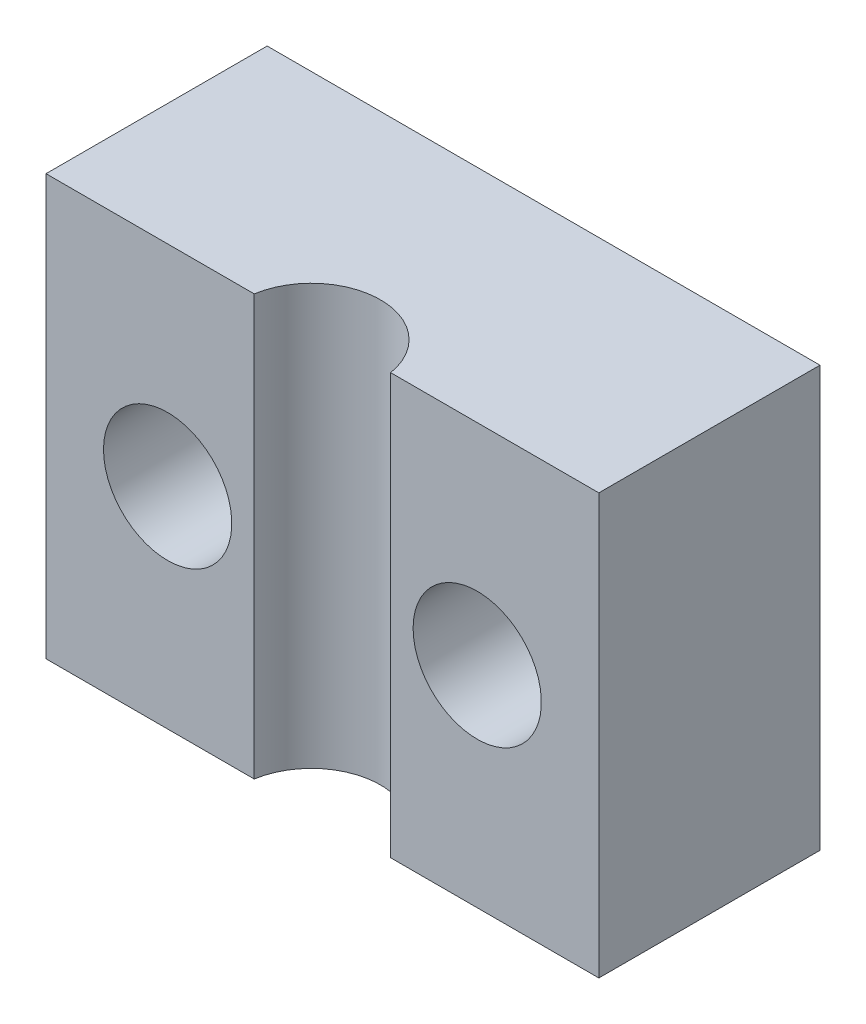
ISO-10303-21;
HEADER;
FILE_DESCRIPTION(('STEP AP214'),'2;1');
FILE_NAME('part.step','',(''),(''),'','','');
FILE_SCHEMA(('AUTOMOTIVE_DESIGN { 1 0 10303 214 1 1 1 1 }'));
ENDSEC;
DATA;
#1=APPLICATION_CONTEXT('core data for automotive mechanical design processes');
#2=APPLICATION_PROTOCOL_DEFINITION('international standard','automotive_design',2000,#1);
#3=PRODUCT_CONTEXT('',#1,'mechanical');
#4=PRODUCT('Part','Part','',(#3));
#5=PRODUCT_RELATED_PRODUCT_CATEGORY('part','',(#4));
#6=PRODUCT_DEFINITION_FORMATION('','',#4);
#7=PRODUCT_DEFINITION_CONTEXT('part definition',#1,'design');
#8=PRODUCT_DEFINITION('design','',#6,#7);
#9=PRODUCT_DEFINITION_SHAPE('','',#8);
#10=(LENGTH_UNIT() NAMED_UNIT(*) SI_UNIT(.MILLI.,.METRE.));
#11=(NAMED_UNIT(*) PLANE_ANGLE_UNIT() SI_UNIT($,.RADIAN.));
#12=(NAMED_UNIT(*) SI_UNIT($,.STERADIAN.) SOLID_ANGLE_UNIT());
#13=UNCERTAINTY_MEASURE_WITH_UNIT(LENGTH_MEASURE(1.E-05),#10,'distance_accuracy_value','');
#14=(GEOMETRIC_REPRESENTATION_CONTEXT(3) GLOBAL_UNCERTAINTY_ASSIGNED_CONTEXT((#13)) GLOBAL_UNIT_ASSIGNED_CONTEXT((#10,
#11,#12)) REPRESENTATION_CONTEXT('',''));
#15=CARTESIAN_POINT('',(0.,0.,0.));
#16=DIRECTION('',(0.,0.,1.));
#17=DIRECTION('',(1.,0.,0.));
#18=AXIS2_PLACEMENT_3D('',#15,#16,#17);
#19=CARTESIAN_POINT('',(0.,9.652,0.));
#20=DIRECTION('',(1.,0.,0.));
#21=DIRECTION('',(0.,0.,-1.));
#22=AXIS2_PLACEMENT_3D('',#19,#20,#21);
#23=PLANE('',#22);
#24=DIRECTION('',(0.,0.,1.));
#25=VECTOR('',#24,1.);
#26=CARTESIAN_POINT('',(0.,0.,0.));
#27=LINE('',#26,#25);
#28=CARTESIAN_POINT('',(0.,0.,-5.08));
#29=VERTEX_POINT('',#28);
#30=CARTESIAN_POINT('',(0.,0.,0.));
#31=VERTEX_POINT('',#30);
#32=EDGE_CURVE('E94',#29,#31,#27,.T.);
#33=ORIENTED_EDGE('',*,*,#32,.T.);
#34=DIRECTION('',(0.,-1.,0.));
#35=VECTOR('',#34,1.);
#36=CARTESIAN_POINT('',(0.,9.652,0.));
#37=LINE('',#36,#35);
#38=CARTESIAN_POINT('',(0.,9.652,0.));
#39=VERTEX_POINT('',#38);
#40=EDGE_CURVE('E13',#39,#31,#37,.T.);
#41=ORIENTED_EDGE('',*,*,#40,.F.);
#42=DIRECTION('',(0.,0.,1.));
#43=VECTOR('',#42,1.);
#44=CARTESIAN_POINT('',(0.,9.652,0.));
#45=LINE('',#44,#43);
#46=CARTESIAN_POINT('',(0.,9.652,-5.08));
#47=VERTEX_POINT('',#46);
#48=EDGE_CURVE('E122',#47,#39,#45,.T.);
#49=ORIENTED_EDGE('',*,*,#48,.F.);
#50=DIRECTION('',(0.,-1.,0.));
#51=VECTOR('',#50,1.);
#52=CARTESIAN_POINT('',(0.,9.652,-5.08));
#53=LINE('',#52,#51);
#54=EDGE_CURVE('E107',#47,#29,#53,.T.);
#55=ORIENTED_EDGE('',*,*,#54,.T.);
#56=EDGE_LOOP('',(#33,#41,#49,#55));
#57=FACE_BOUND('',#56,.T.);
#58=ADVANCED_FACE('F38',(#57),#23,.F.);
#59=CARTESIAN_POINT('',(0.,9.652,0.));
#60=DIRECTION('',(0.,0.,-1.));
#61=DIRECTION('',(-1.,0.,0.));
#62=AXIS2_PLACEMENT_3D('',#59,#60,#61);
#63=PLANE('',#62);
#64=CARTESIAN_POINT('',(2.794,4.826,0.));
#65=DIRECTION('',(0.,0.,-1.));
#66=DIRECTION('',(-1.,0.,0.));
#67=AXIS2_PLACEMENT_3D('',#64,#65,#66);
#68=CIRCLE('',#67,1.4732);
#69=CARTESIAN_POINT('',(1.3208,4.826,0.));
#70=VERTEX_POINT('',#69);
#71=EDGE_CURVE('E190',#70,#70,#68,.T.);
#72=ORIENTED_EDGE('',*,*,#71,.T.);
#73=EDGE_LOOP('',(#72));
#74=FACE_BOUND('',#73,.T.);
#75=DIRECTION('',(1.,0.,0.));
#76=VECTOR('',#75,1.);
#77=CARTESIAN_POINT('',(0.,0.,0.));
#78=LINE('',#77,#76);
#79=CARTESIAN_POINT('',(4.78295173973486,0.,0.));
#80=VERTEX_POINT('',#79);
#81=EDGE_CURVE('E90',#31,#80,#78,.T.);
#82=ORIENTED_EDGE('',*,*,#81,.T.);
#83=DIRECTION('',(0.,-1.,0.));
#84=VECTOR('',#83,1.);
#85=CARTESIAN_POINT('',(4.78295173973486,9.652,0.));
#86=LINE('',#85,#84);
#87=CARTESIAN_POINT('',(4.78295173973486,9.652,0.));
#88=VERTEX_POINT('',#87);
#89=EDGE_CURVE('E45',#88,#80,#86,.T.);
#90=ORIENTED_EDGE('',*,*,#89,.F.);
#91=DIRECTION('',(1.,0.,0.));
#92=VECTOR('',#91,1.);
#93=CARTESIAN_POINT('',(0.,9.652,0.));
#94=LINE('',#93,#92);
#95=EDGE_CURVE('E103',#39,#88,#94,.T.);
#96=ORIENTED_EDGE('',*,*,#95,.F.);
#97=ORIENTED_EDGE('',*,*,#40,.T.);
#98=EDGE_LOOP('',(#82,#90,#96,#97));
#99=FACE_BOUND('',#98,.T.);
#100=ADVANCED_FACE('F102',(#74,#99),#63,.F.);
#101=CARTESIAN_POINT('',(6.35,9.652,0.254));
#102=DIRECTION('',(0.,-1.,0.));
#103=DIRECTION('',(0.,0.,-1.));
#104=AXIS2_PLACEMENT_3D('',#101,#102,#103);
#105=CYLINDRICAL_SURFACE('',#104,1.5875);
#106=CARTESIAN_POINT('',(6.35,0.,0.254));
#107=DIRECTION('',(0.,-1.,0.));
#108=DIRECTION('',(0.,0.,1.));
#109=AXIS2_PLACEMENT_3D('',#106,#107,#108);
#110=CIRCLE('',#109,1.5875);
#111=CARTESIAN_POINT('',(7.91704826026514,0.,0.));
#112=VERTEX_POINT('',#111);
#113=EDGE_CURVE('E96',#80,#112,#110,.T.);
#114=ORIENTED_EDGE('',*,*,#113,.T.);
#115=DIRECTION('',(0.,-1.,0.));
#116=VECTOR('',#115,1.);
#117=CARTESIAN_POINT('',(7.91704826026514,9.652,0.));
#118=LINE('',#117,#116);
#119=CARTESIAN_POINT('',(7.91704826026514,9.652,0.));
#120=VERTEX_POINT('',#119);
#121=EDGE_CURVE('E138',#120,#112,#118,.T.);
#122=ORIENTED_EDGE('',*,*,#121,.F.);
#123=CARTESIAN_POINT('',(6.35,9.652,0.254));
#124=DIRECTION('',(0.,-1.,0.));
#125=DIRECTION('',(0.,0.,1.));
#126=AXIS2_PLACEMENT_3D('',#123,#124,#125);
#127=CIRCLE('',#126,1.5875);
#128=EDGE_CURVE('E125',#88,#120,#127,.T.);
#129=ORIENTED_EDGE('',*,*,#128,.F.);
#130=ORIENTED_EDGE('',*,*,#89,.T.);
#131=EDGE_LOOP('',(#114,#122,#129,#130));
#132=FACE_BOUND('',#131,.T.);
#133=ADVANCED_FACE('F142',(#132),#105,.F.);
#134=CARTESIAN_POINT('',(7.91704826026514,9.652,0.));
#135=DIRECTION('',(0.,0.,-1.));
#136=DIRECTION('',(-1.,0.,0.));
#137=AXIS2_PLACEMENT_3D('',#134,#135,#136);
#138=PLANE('',#137);
#139=CARTESIAN_POINT('',(9.906,4.826,0.));
#140=DIRECTION('',(0.,0.,-1.));
#141=DIRECTION('',(-1.,0.,0.));
#142=AXIS2_PLACEMENT_3D('',#139,#140,#141);
#143=CIRCLE('',#142,1.4732);
#144=CARTESIAN_POINT('',(8.4328,4.826,0.));
#145=VERTEX_POINT('',#144);
#146=EDGE_CURVE('E108',#145,#145,#143,.T.);
#147=ORIENTED_EDGE('',*,*,#146,.T.);
#148=EDGE_LOOP('',(#147));
#149=FACE_BOUND('',#148,.T.);
#150=DIRECTION('',(1.,0.,0.));
#151=VECTOR('',#150,1.);
#152=CARTESIAN_POINT('',(7.91704826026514,0.,0.));
#153=LINE('',#152,#151);
#154=CARTESIAN_POINT('',(12.7,0.,0.));
#155=VERTEX_POINT('',#154);
#156=EDGE_CURVE('E116',#112,#155,#153,.T.);
#157=ORIENTED_EDGE('',*,*,#156,.T.);
#158=DIRECTION('',(0.,-1.,0.));
#159=VECTOR('',#158,1.);
#160=CARTESIAN_POINT('',(12.7,9.652,0.));
#161=LINE('',#160,#159);
#162=CARTESIAN_POINT('',(12.7,9.652,0.));
#163=VERTEX_POINT('',#162);
#164=EDGE_CURVE('E135',#163,#155,#161,.T.);
#165=ORIENTED_EDGE('',*,*,#164,.F.);
#166=DIRECTION('',(1.,0.,0.));
#167=VECTOR('',#166,1.);
#168=CARTESIAN_POINT('',(7.91704826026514,9.652,0.));
#169=LINE('',#168,#167);
#170=EDGE_CURVE('E127',#120,#163,#169,.T.);
#171=ORIENTED_EDGE('',*,*,#170,.F.);
#172=ORIENTED_EDGE('',*,*,#121,.T.);
#173=EDGE_LOOP('',(#157,#165,#171,#172));
#174=FACE_BOUND('',#173,.T.);
#175=ADVANCED_FACE('F148',(#149,#174),#138,.F.);
#176=CARTESIAN_POINT('',(12.7,9.652,0.));
#177=DIRECTION('',(-1.,0.,0.));
#178=DIRECTION('',(0.,0.,1.));
#179=AXIS2_PLACEMENT_3D('',#176,#177,#178);
#180=PLANE('',#179);
#181=DIRECTION('',(0.,0.,-1.));
#182=VECTOR('',#181,1.);
#183=CARTESIAN_POINT('',(12.7,0.,0.));
#184=LINE('',#183,#182);
#185=CARTESIAN_POINT('',(12.7,0.,-5.08));
#186=VERTEX_POINT('',#185);
#187=EDGE_CURVE('E118',#155,#186,#184,.T.);
#188=ORIENTED_EDGE('',*,*,#187,.T.);
#189=DIRECTION('',(0.,-1.,0.));
#190=VECTOR('',#189,1.);
#191=CARTESIAN_POINT('',(12.7,9.652,-5.08));
#192=LINE('',#191,#190);
#193=CARTESIAN_POINT('',(12.7,9.652,-5.08));
#194=VERTEX_POINT('',#193);
#195=EDGE_CURVE('E132',#194,#186,#192,.T.);
#196=ORIENTED_EDGE('',*,*,#195,.F.);
#197=DIRECTION('',(0.,0.,-1.));
#198=VECTOR('',#197,1.);
#199=CARTESIAN_POINT('',(12.7,9.652,0.));
#200=LINE('',#199,#198);
#201=EDGE_CURVE('E57',#163,#194,#200,.T.);
#202=ORIENTED_EDGE('',*,*,#201,.F.);
#203=ORIENTED_EDGE('',*,*,#164,.T.);
#204=EDGE_LOOP('',(#188,#196,#202,#203));
#205=FACE_BOUND('',#204,.T.);
#206=ADVANCED_FACE('F151',(#205),#180,.F.);
#207=CARTESIAN_POINT('',(0.,9.652,-5.08));
#208=DIRECTION('',(0.,0.,1.));
#209=DIRECTION('',(1.,0.,0.));
#210=AXIS2_PLACEMENT_3D('',#207,#208,#209);
#211=PLANE('',#210);
#212=CARTESIAN_POINT('',(2.794,4.826,-5.08));
#213=DIRECTION('',(0.,0.,-1.));
#214=DIRECTION('',(-1.,0.,0.));
#215=AXIS2_PLACEMENT_3D('',#212,#213,#214);
#216=CIRCLE('',#215,1.4732);
#217=CARTESIAN_POINT('',(1.3208,4.826,-5.08));
#218=VERTEX_POINT('',#217);
#219=EDGE_CURVE('E191',#218,#218,#216,.T.);
#220=ORIENTED_EDGE('',*,*,#219,.F.);
#221=EDGE_LOOP('',(#220));
#222=FACE_BOUND('',#221,.T.);
#223=CARTESIAN_POINT('',(9.906,4.826,-5.08));
#224=DIRECTION('',(0.,0.,-1.));
#225=DIRECTION('',(-1.,0.,0.));
#226=AXIS2_PLACEMENT_3D('',#223,#224,#225);
#227=CIRCLE('',#226,1.4732);
#228=CARTESIAN_POINT('',(8.4328,4.826,-5.08));
#229=VERTEX_POINT('',#228);
#230=EDGE_CURVE('E111',#229,#229,#227,.T.);
#231=ORIENTED_EDGE('',*,*,#230,.F.);
#232=EDGE_LOOP('',(#231));
#233=FACE_BOUND('',#232,.T.);
#234=DIRECTION('',(-1.,0.,0.));
#235=VECTOR('',#234,1.);
#236=CARTESIAN_POINT('',(0.,0.,-5.08));
#237=LINE('',#236,#235);
#238=EDGE_CURVE('E120',#186,#29,#237,.T.);
#239=ORIENTED_EDGE('',*,*,#238,.T.);
#240=ORIENTED_EDGE('',*,*,#54,.F.);
#241=DIRECTION('',(-1.,0.,0.));
#242=VECTOR('',#241,1.);
#243=CARTESIAN_POINT('',(0.,9.652,-5.08));
#244=LINE('',#243,#242);
#245=EDGE_CURVE('E52',#194,#47,#244,.T.);
#246=ORIENTED_EDGE('',*,*,#245,.F.);
#247=ORIENTED_EDGE('',*,*,#195,.T.);
#248=EDGE_LOOP('',(#239,#240,#246,#247));
#249=FACE_BOUND('',#248,.T.);
#250=ADVANCED_FACE('F153',(#222,#233,#249),#211,.F.);
#251=CARTESIAN_POINT('',(6.35,9.652,0.254));
#252=DIRECTION('',(0.,1.,0.));
#253=DIRECTION('',(0.,0.,1.));
#254=AXIS2_PLACEMENT_3D('',#251,#252,#253);
#255=PLANE('',#254);
#256=ORIENTED_EDGE('',*,*,#48,.T.);
#257=ORIENTED_EDGE('',*,*,#95,.T.);
#258=ORIENTED_EDGE('',*,*,#128,.T.);
#259=ORIENTED_EDGE('',*,*,#170,.T.);
#260=ORIENTED_EDGE('',*,*,#201,.T.);
#261=ORIENTED_EDGE('',*,*,#245,.T.);
#262=EDGE_LOOP('',(#256,#257,#258,#259,#260,#261));
#263=FACE_BOUND('',#262,.T.);
#264=ADVANCED_FACE('F145',(#263),#255,.T.);
#265=CARTESIAN_POINT('',(6.35,0.,0.254));
#266=DIRECTION('',(0.,1.,0.));
#267=DIRECTION('',(0.,0.,1.));
#268=AXIS2_PLACEMENT_3D('',#265,#266,#267);
#269=PLANE('',#268);
#270=ORIENTED_EDGE('',*,*,#32,.F.);
#271=ORIENTED_EDGE('',*,*,#238,.F.);
#272=ORIENTED_EDGE('',*,*,#187,.F.);
#273=ORIENTED_EDGE('',*,*,#156,.F.);
#274=ORIENTED_EDGE('',*,*,#113,.F.);
#275=ORIENTED_EDGE('',*,*,#81,.F.);
#276=EDGE_LOOP('',(#270,#271,#272,#273,#274,#275));
#277=FACE_BOUND('',#276,.T.);
#278=ADVANCED_FACE('F91',(#277),#269,.F.);
#279=CARTESIAN_POINT('',(9.906,4.826,0.));
#280=DIRECTION('',(0.,0.,-1.));
#281=DIRECTION('',(-1.,0.,0.));
#282=AXIS2_PLACEMENT_3D('',#279,#280,#281);
#283=CYLINDRICAL_SURFACE('',#282,1.4732);
#284=ORIENTED_EDGE('',*,*,#146,.F.);
#285=EDGE_LOOP('',(#284));
#286=FACE_BOUND('',#285,.T.);
#287=ORIENTED_EDGE('',*,*,#230,.T.);
#288=EDGE_LOOP('',(#287));
#289=FACE_BOUND('',#288,.T.);
#290=ADVANCED_FACE('F184',(#286,#289),#283,.F.);
#291=CARTESIAN_POINT('',(2.794,4.826,0.));
#292=DIRECTION('',(0.,0.,-1.));
#293=DIRECTION('',(-1.,0.,0.));
#294=AXIS2_PLACEMENT_3D('',#291,#292,#293);
#295=CYLINDRICAL_SURFACE('',#294,1.4732);
#296=ORIENTED_EDGE('',*,*,#71,.F.);
#297=EDGE_LOOP('',(#296));
#298=FACE_BOUND('',#297,.T.);
#299=ORIENTED_EDGE('',*,*,#219,.T.);
#300=EDGE_LOOP('',(#299));
#301=FACE_BOUND('',#300,.T.);
#302=ADVANCED_FACE('F186',(#298,#301),#295,.F.);
#303=CLOSED_SHELL('',(#58,#100,#133,#175,#206,#250,#264,#278,#290,#302));
#304=MANIFOLD_SOLID_BREP('B2',#303);
#305=ADVANCED_BREP_SHAPE_REPRESENTATION('',(#18,#304),#14);
#306=SHAPE_DEFINITION_REPRESENTATION(#9,#305);
ENDSEC;
END-ISO-10303-21;
